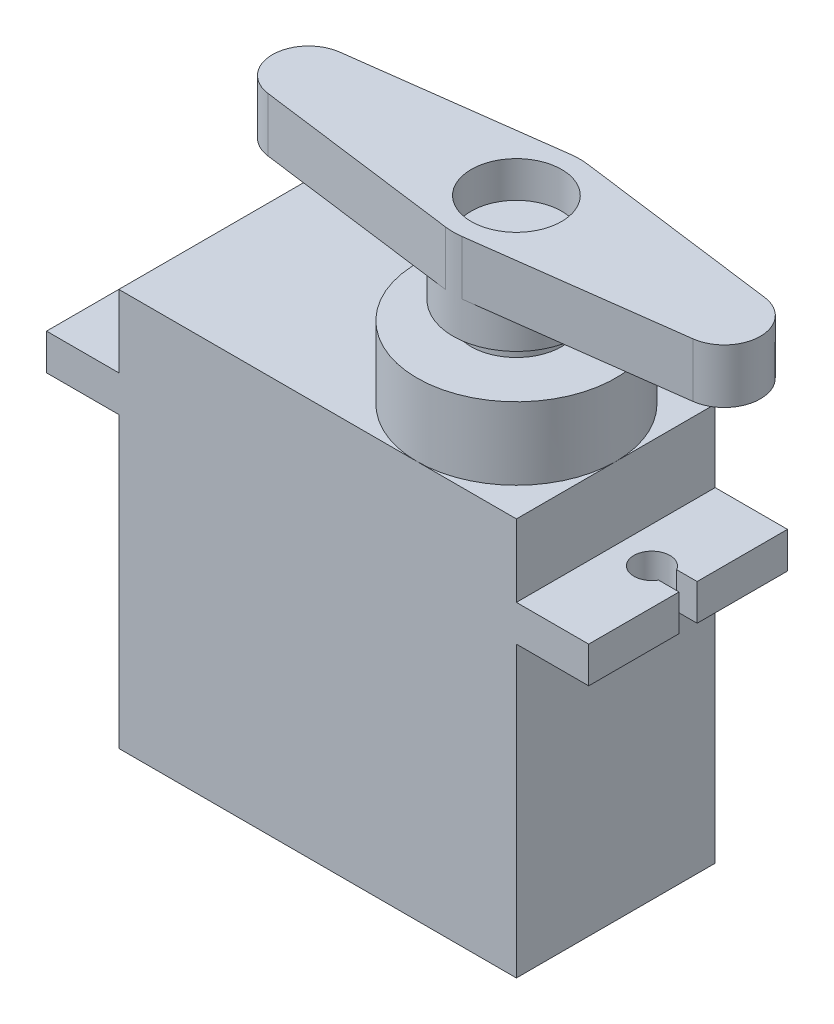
from build123d import *

# Parameters (mm, degrees)
SKETCH1_W                = 22
SKETCH1_H                = 11
BOSS_EXTRUDE1_DEPTH      = 22
SKETCH2_W                = 11
SKETCH2_H                = 2
BOSS_EXTRUDE2_DEPTH      = 4
CUT_EXTRUDE2_DEPTH       = 2
SKETCH4_R                = 5.5
BOSS_EXTRUDE3_DEPTH      = 4
SKETCH5_R                = 2.5
BOSS_EXTRUDE4_DEPTH      = 4
BOSS_EXTRUDE5_DEPTH      = 2
BOSS_EXTRUDE5_DEPTH_BACK = 3
SKETCH7_R                = 3.5
SKETCH7_R_2              = 2.5
BOSS_EXTRUDE6_DEPTH      = 3


with BuildPart() as part:
    # Sketch1 → Boss-Extrude1 (new body)
    with BuildSketch(Plane(origin=(0, 0, 0), x_dir=(1, 0, 0), z_dir=(0, 1, 0))):
        Rectangle(SKETCH1_W, SKETCH1_H)
    extrude(amount=BOSS_EXTRUDE1_DEPTH)

    # Sketch2 → Boss-Extrude2 (add)
    with BuildSketch(Plane(origin=(11, 0, 0), x_dir=(0, 0, -1), z_dir=(1, 0, 0))):
        with Locations((0, 17)):
            Rectangle(SKETCH2_W, SKETCH2_H)
    boss_extrude2 = extrude(amount=BOSS_EXTRUDE2_DEPTH)

    # Sketch3 → Cut-Extrude2 (cut)
    with BuildSketch(Plane(origin=(0, 18, 0), x_dir=(1, 0, 0), z_dir=(0, 1, 0))):
        with BuildLine():
            Line((15, 0.5), (13.866025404, 0.5))
            ThreePointArc((13.866025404, 0.5), (12, 0), (13.866025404, -0.5))
            Line((13.866025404, -0.5), (15, -0.5))
            Line((15, -0.5), (15, 0.5))
        make_face()
    cut_extrude2 = extrude(amount=-CUT_EXTRUDE2_DEPTH, mode=Mode.SUBTRACT)

    # Mirror1: Boss-Extrude2, Cut-Extrude2 across plane
    add(boss_extrude2.mirror(Plane(origin=(0, 0, 0), x_dir=(0, 0, 1), z_dir=(1, 0, 0))))
    add(cut_extrude2.mirror(Plane(origin=(0, 0, 0), x_dir=(0, 0, 1), z_dir=(1, 0, 0))), mode=Mode.SUBTRACT)

    # Sketch4 → Boss-Extrude3 (add)
    with BuildSketch(Plane(origin=(0, 22, 0), x_dir=(1, 0, 0), z_dir=(0, 1, 0))):
        with Locations(Location((5.5, 0, 0), (0, 0, 270))):
            Circle(SKETCH4_R)
    extrude(amount=BOSS_EXTRUDE3_DEPTH)

    # Sketch5 → Boss-Extrude4 (add)
    with BuildSketch(Plane(origin=(0, 26, 0), x_dir=(1, 0, 0), z_dir=(0, 1, 0))):
        with Locations(Location((5.5, 0, 0), (0, 0, 270))):
            Circle(SKETCH5_R)
    extrude(amount=BOSS_EXTRUDE4_DEPTH)

    # Sketch7 → Boss-Extrude5 (add, two sides: drawn at the far end of the back side and taken through both)
    with BuildSketch(Plane(origin=(0, 30, 0), x_dir=(1, 0, 0), z_dir=(0, 1, 0)).offset(-BOSS_EXTRUDE5_DEPTH_BACK)):
        with Locations(Location((5.5, 0, 0), (0, 0, 270))):
            Circle(SKETCH7_R)
        with Locations(Location((5.5, 0, 0), (0, 0, 270))):
            Circle(SKETCH7_R_2, mode=Mode.SUBTRACT)
    extrude(amount=BOSS_EXTRUDE5_DEPTH + BOSS_EXTRUDE5_DEPTH_BACK)

    # Sketch8 → Boss-Extrude6 (add)
    with BuildSketch(Plane(origin=(0, 32, 0), x_dir=(1, 0, 0), z_dir=(0, 1, 0))):
        with BuildLine():
            Line((5.956521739, 3.47009912), (17.260869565, 1.982913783))
            ThreePointArc((17.260869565, 1.982913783), (19, 0), (17.260869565, -1.982913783))
            Line((17.260869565, -1.982913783), (5.956521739, -3.47009912))
            ThreePointArc((5.956521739, -3.47009912), (9, 0), (5.956521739, 3.47009912))
        make_face()
        with BuildLine():
            Line((5.043478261, -3.47009912), (-6.260869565, -1.982913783))
            ThreePointArc((-6.260869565, -1.982913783), (-8, 0), (-6.260869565, 1.982913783))
            Line((-6.260869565, 1.982913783), (5.043478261, 3.47009912))
            ThreePointArc((5.043478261, 3.47009912), (2, 0), (5.043478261, -3.47009912))
        make_face()
    extrude(amount=-BOSS_EXTRUDE6_DEPTH)


solid = part.part
